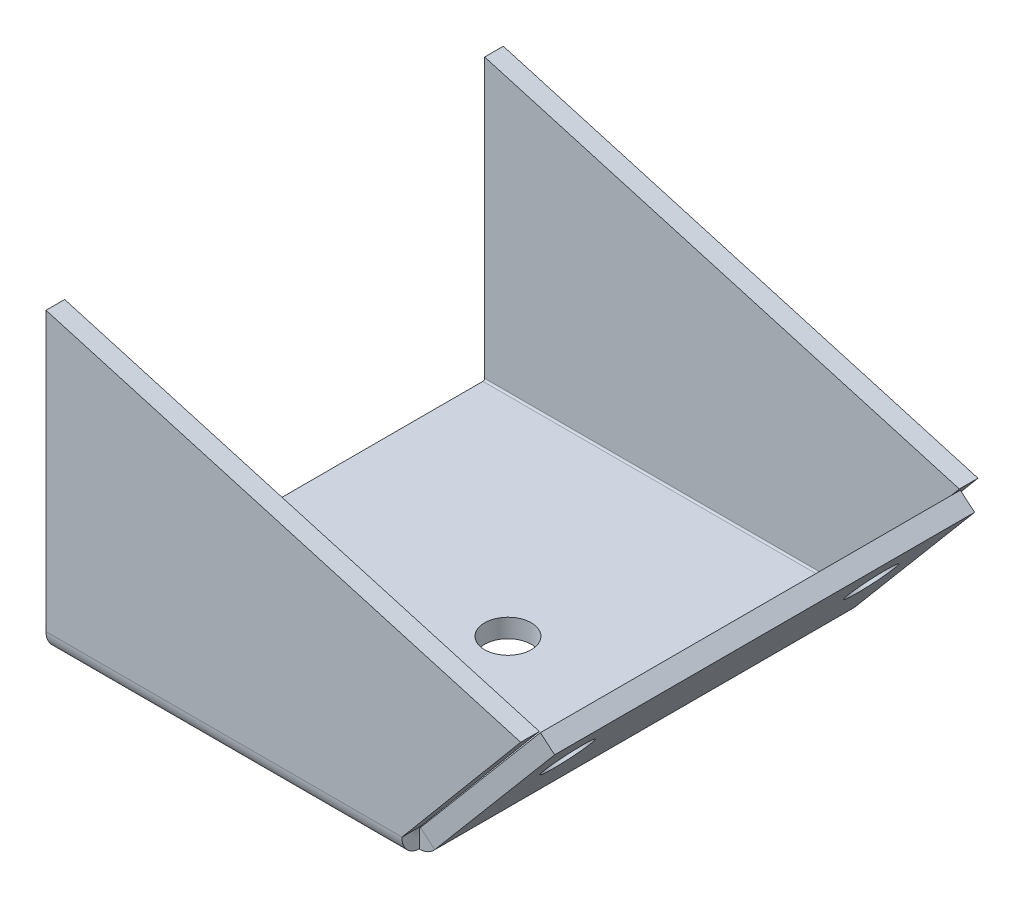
ISO-10303-21;
HEADER;
FILE_DESCRIPTION(('STEP AP214'),'2;1');
FILE_NAME('part.step','',(''),(''),'','','');
FILE_SCHEMA(('AUTOMOTIVE_DESIGN { 1 0 10303 214 1 1 1 1 }'));
ENDSEC;
DATA;
#1=APPLICATION_CONTEXT('core data for automotive mechanical design processes');
#2=APPLICATION_PROTOCOL_DEFINITION('international standard','automotive_design',2000,#1);
#3=PRODUCT_CONTEXT('',#1,'mechanical');
#4=PRODUCT('Part','Part','',(#3));
#5=PRODUCT_RELATED_PRODUCT_CATEGORY('part','',(#4));
#6=PRODUCT_DEFINITION_FORMATION('','',#4);
#7=PRODUCT_DEFINITION_CONTEXT('part definition',#1,'design');
#8=PRODUCT_DEFINITION('design','',#6,#7);
#9=PRODUCT_DEFINITION_SHAPE('','',#8);
#10=(LENGTH_UNIT() NAMED_UNIT(*) SI_UNIT(.MILLI.,.METRE.));
#11=(NAMED_UNIT(*) PLANE_ANGLE_UNIT() SI_UNIT($,.RADIAN.));
#12=(NAMED_UNIT(*) SI_UNIT($,.STERADIAN.) SOLID_ANGLE_UNIT());
#13=UNCERTAINTY_MEASURE_WITH_UNIT(LENGTH_MEASURE(1.E-05),#10,'distance_accuracy_value','');
#14=(GEOMETRIC_REPRESENTATION_CONTEXT(3) GLOBAL_UNCERTAINTY_ASSIGNED_CONTEXT((#13)) GLOBAL_UNIT_ASSIGNED_CONTEXT((#10,
#11,#12)) REPRESENTATION_CONTEXT('',''));
#15=CARTESIAN_POINT('',(0.,0.,0.));
#16=DIRECTION('',(0.,0.,1.));
#17=DIRECTION('',(1.,0.,0.));
#18=AXIS2_PLACEMENT_3D('',#15,#16,#17);
#19=CARTESIAN_POINT('',(-156.,8.,90.));
#20=DIRECTION('',(0.,1.,0.));
#21=DIRECTION('',(0.,0.,1.));
#22=AXIS2_PLACEMENT_3D('',#19,#20,#21);
#23=PLANE('',#22);
#24=CARTESIAN_POINT('',(-56.,8.,0.));
#25=DIRECTION('',(0.,1.,0.));
#26=DIRECTION('',(0.,0.,1.));
#27=AXIS2_PLACEMENT_3D('',#24,#25,#26);
#28=CIRCLE('',#27,10.);
#29=CARTESIAN_POINT('',(-56.,8.,10.));
#30=VERTEX_POINT('',#29);
#31=EDGE_CURVE('E536',#30,#30,#28,.T.);
#32=ORIENTED_EDGE('',*,*,#31,.F.);
#33=EDGE_LOOP('',(#32));
#34=FACE_BOUND('',#33,.T.);
#35=DIRECTION('',(0.,0.,-1.));
#36=VECTOR('',#35,1.);
#37=CARTESIAN_POINT('',(-4.05947288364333,8.,90.));
#38=LINE('',#37,#36);
#39=CARTESIAN_POINT('',(-4.05947288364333,8.,89.2634));
#40=VERTEX_POINT('',#39);
#41=CARTESIAN_POINT('',(-4.05947288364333,8.,-89.2633999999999));
#42=VERTEX_POINT('',#41);
#43=EDGE_CURVE('E397',#40,#42,#38,.T.);
#44=ORIENTED_EDGE('',*,*,#43,.T.);
#45=DIRECTION('',(-1.,0.,0.));
#46=VECTOR('',#45,1.);
#47=CARTESIAN_POINT('',(-156.,7.99999999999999,-89.2634));
#48=LINE('',#47,#46);
#49=CARTESIAN_POINT('',(-156.,8.,-89.2633999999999));
#50=VERTEX_POINT('',#49);
#51=EDGE_CURVE('E64',#50,#42,#48,.F.);
#52=ORIENTED_EDGE('',*,*,#51,.F.);
#53=DIRECTION('',(0.,0.,-1.));
#54=VECTOR('',#53,1.);
#55=CARTESIAN_POINT('',(-156.,8.,90.));
#56=LINE('',#55,#54);
#57=CARTESIAN_POINT('',(-156.,8.,89.2634));
#58=VERTEX_POINT('',#57);
#59=EDGE_CURVE('E395',#58,#50,#56,.T.);
#60=ORIENTED_EDGE('',*,*,#59,.F.);
#61=DIRECTION('',(1.,0.,0.));
#62=VECTOR('',#61,1.);
#63=CARTESIAN_POINT('',(-3.44139209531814,8.,89.2634));
#64=LINE('',#63,#62);
#65=EDGE_CURVE('E309',#40,#58,#64,.F.);
#66=ORIENTED_EDGE('',*,*,#65,.F.);
#67=EDGE_LOOP('',(#44,#52,#60,#66));
#68=FACE_BOUND('',#67,.T.);
#69=ADVANCED_FACE('F41',(#34,#68),#23,.T.);
#70=CARTESIAN_POINT('',(-156.,0.,90.));
#71=DIRECTION('',(0.,1.,0.));
#72=DIRECTION('',(0.,0.,1.));
#73=AXIS2_PLACEMENT_3D('',#70,#71,#72);
#74=PLANE('',#73);
#75=CARTESIAN_POINT('',(-56.,0.,0.));
#76=DIRECTION('',(0.,1.,0.));
#77=DIRECTION('',(0.,0.,1.));
#78=AXIS2_PLACEMENT_3D('',#75,#76,#77);
#79=CIRCLE('',#78,10.);
#80=CARTESIAN_POINT('',(-56.,0.,10.));
#81=VERTEX_POINT('',#80);
#82=EDGE_CURVE('E45',#81,#81,#79,.T.);
#83=ORIENTED_EDGE('',*,*,#82,.T.);
#84=EDGE_LOOP('',(#83));
#85=FACE_BOUND('',#84,.T.);
#86=DIRECTION('',(-1.,0.,0.));
#87=VECTOR('',#86,1.);
#88=CARTESIAN_POINT('',(-156.,0.,-89.2634));
#89=LINE('',#88,#87);
#90=CARTESIAN_POINT('',(-156.,0.,-89.2634));
#91=VERTEX_POINT('',#90);
#92=CARTESIAN_POINT('',(-4.05947288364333,0.,-89.2633999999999));
#93=VERTEX_POINT('',#92);
#94=EDGE_CURVE('E176',#91,#93,#89,.F.);
#95=ORIENTED_EDGE('',*,*,#94,.T.);
#96=DIRECTION('',(0.,0.,-1.));
#97=VECTOR('',#96,1.);
#98=CARTESIAN_POINT('',(-4.05947288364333,0.,90.));
#99=LINE('',#98,#97);
#100=CARTESIAN_POINT('',(-4.05947288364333,0.,89.2634));
#101=VERTEX_POINT('',#100);
#102=EDGE_CURVE('E390',#101,#93,#99,.T.);
#103=ORIENTED_EDGE('',*,*,#102,.F.);
#104=DIRECTION('',(1.,0.,0.));
#105=VECTOR('',#104,1.);
#106=CARTESIAN_POINT('',(-3.44139209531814,0.,89.2634));
#107=LINE('',#106,#105);
#108=CARTESIAN_POINT('',(-156.,0.,89.2634));
#109=VERTEX_POINT('',#108);
#110=EDGE_CURVE('E304',#101,#109,#107,.F.);
#111=ORIENTED_EDGE('',*,*,#110,.T.);
#112=DIRECTION('',(0.,0.,-1.));
#113=VECTOR('',#112,1.);
#114=CARTESIAN_POINT('',(-156.,0.,90.));
#115=LINE('',#114,#113);
#116=EDGE_CURVE('E393',#109,#91,#115,.T.);
#117=ORIENTED_EDGE('',*,*,#116,.T.);
#118=EDGE_LOOP('',(#95,#103,#111,#117));
#119=FACE_BOUND('',#118,.T.);
#120=ADVANCED_FACE('F481',(#85,#119),#74,.F.);
#121=CARTESIAN_POINT('',(-156.,0.,90.));
#122=DIRECTION('',(-1.,0.,0.));
#123=DIRECTION('',(0.,0.,1.));
#124=AXIS2_PLACEMENT_3D('',#121,#122,#123);
#125=PLANE('',#124);
#126=ORIENTED_EDGE('',*,*,#59,.T.);
#127=DIRECTION('',(0.,-1.,0.));
#128=VECTOR('',#127,1.);
#129=CARTESIAN_POINT('',(-156.,7.99999999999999,-89.2634));
#130=LINE('',#129,#128);
#131=EDGE_CURVE('E263',#50,#91,#130,.T.);
#132=ORIENTED_EDGE('',*,*,#131,.T.);
#133=ORIENTED_EDGE('',*,*,#116,.F.);
#134=DIRECTION('',(0.,-1.,0.));
#135=VECTOR('',#134,1.);
#136=CARTESIAN_POINT('',(-156.,8.,89.2634));
#137=LINE('',#136,#135);
#138=EDGE_CURVE('E377',#58,#109,#137,.T.);
#139=ORIENTED_EDGE('',*,*,#138,.F.);
#140=EDGE_LOOP('',(#126,#132,#133,#139));
#141=FACE_BOUND('',#140,.T.);
#142=ADVANCED_FACE('F488',(#141),#125,.T.);
#143=CARTESIAN_POINT('',(-4.05947288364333,0.,90.));
#144=DIRECTION('',(0.,0.,1.));
#145=DIRECTION('',(1.,0.,0.));
#146=AXIS2_PLACEMENT_3D('',#143,#144,#145);
#147=PLANE('',#146);
#148=DIRECTION('',(0.,1.,0.));
#149=VECTOR('',#148,1.);
#150=CARTESIAN_POINT('',(-4.05947288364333,0.,90.));
#151=LINE('',#150,#149);
#152=CARTESIAN_POINT('',(-4.05947288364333,0.,90.));
#153=VERTEX_POINT('',#152);
#154=CARTESIAN_POINT('',(-4.05947288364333,8.,90.));
#155=VERTEX_POINT('',#154);
#156=EDGE_CURVE('E11',#153,#155,#151,.T.);
#157=ORIENTED_EDGE('',*,*,#156,.F.);
#158=CARTESIAN_POINT('',(-4.05947288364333,8.7366,90.));
#159=DIRECTION('',(0.,0.,-1.));
#160=DIRECTION('',(-1.,0.,0.));
#161=AXIS2_PLACEMENT_3D('',#158,#159,#160);
#162=CIRCLE('',#161,8.7366);
#163=CARTESIAN_POINT('',(2.61783609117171,3.10262055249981,90.));
#164=VERTEX_POINT('',#163);
#165=EDGE_CURVE('E369',#153,#164,#162,.F.);
#166=ORIENTED_EDGE('',*,*,#165,.T.);
#167=DIRECTION('',(0.764291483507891,-0.644870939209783,0.));
#168=VECTOR('',#167,1.);
#169=CARTESIAN_POINT('',(-3.49649577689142,8.26158806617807,90.));
#170=LINE('',#169,#168);
#171=CARTESIAN_POINT('',(-3.49649577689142,8.26158806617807,90.));
#172=VERTEX_POINT('',#171);
#173=EDGE_CURVE('E50',#172,#164,#170,.T.);
#174=ORIENTED_EDGE('',*,*,#173,.F.);
#175=CARTESIAN_POINT('',(-4.05947288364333,8.7366,90.));
#176=DIRECTION('',(0.,0.,1.));
#177=DIRECTION('',(1.,0.,0.));
#178=AXIS2_PLACEMENT_3D('',#175,#176,#177);
#179=CIRCLE('',#178,0.7366);
#180=EDGE_CURVE('E366',#155,#172,#179,.T.);
#181=ORIENTED_EDGE('',*,*,#180,.F.);
#182=EDGE_LOOP('',(#157,#166,#174,#181));
#183=FACE_BOUND('',#182,.T.);
#184=ADVANCED_FACE('F43',(#183),#147,.T.);
#185=CARTESIAN_POINT('',(2.61783609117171,3.10262055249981,-90.));
#186=DIRECTION('',(0.,0.,-1.));
#187=DIRECTION('',(-1.,0.,0.));
#188=AXIS2_PLACEMENT_3D('',#185,#186,#187);
#189=PLANE('',#188);
#190=DIRECTION('',(-0.764291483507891,0.644870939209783,0.));
#191=VECTOR('',#190,1.);
#192=CARTESIAN_POINT('',(2.61783609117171,3.10262055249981,-90.));
#193=LINE('',#192,#191);
#194=CARTESIAN_POINT('',(2.61783609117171,3.10262055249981,-90.));
#195=VERTEX_POINT('',#194);
#196=CARTESIAN_POINT('',(-3.49649577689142,8.26158806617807,-90.));
#197=VERTEX_POINT('',#196);
#198=EDGE_CURVE('E410',#195,#197,#193,.T.);
#199=ORIENTED_EDGE('',*,*,#198,.F.);
#200=CARTESIAN_POINT('',(-4.05947288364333,8.7366,-90.));
#201=DIRECTION('',(0.,0.,-1.));
#202=DIRECTION('',(-1.,0.,0.));
#203=AXIS2_PLACEMENT_3D('',#200,#201,#202);
#204=CIRCLE('',#203,8.7366);
#205=CARTESIAN_POINT('',(-4.05947288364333,0.,-90.));
#206=VERTEX_POINT('',#205);
#207=EDGE_CURVE('E360',#206,#195,#204,.F.);
#208=ORIENTED_EDGE('',*,*,#207,.F.);
#209=DIRECTION('',(0.,-1.,0.));
#210=VECTOR('',#209,1.);
#211=CARTESIAN_POINT('',(-4.05947288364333,8.,-90.));
#212=LINE('',#211,#210);
#213=CARTESIAN_POINT('',(-4.05947288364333,8.,-90.));
#214=VERTEX_POINT('',#213);
#215=EDGE_CURVE('E407',#214,#206,#212,.T.);
#216=ORIENTED_EDGE('',*,*,#215,.F.);
#217=CARTESIAN_POINT('',(-4.05947288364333,8.7366,-90.));
#218=DIRECTION('',(0.,0.,1.));
#219=DIRECTION('',(1.,0.,0.));
#220=AXIS2_PLACEMENT_3D('',#217,#218,#219);
#221=CIRCLE('',#220,0.7366);
#222=EDGE_CURVE('E383',#214,#197,#221,.T.);
#223=ORIENTED_EDGE('',*,*,#222,.T.);
#224=EDGE_LOOP('',(#199,#208,#216,#223));
#225=FACE_BOUND('',#224,.T.);
#226=ADVANCED_FACE('F506',(#225),#189,.T.);
#227=CARTESIAN_POINT('',(-4.05947288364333,8.,-90.));
#228=DIRECTION('',(0.,0.,-1.));
#229=DIRECTION('',(-1.,0.,0.));
#230=AXIS2_PLACEMENT_3D('',#227,#228,#229);
#231=PLANE('',#230);
#232=DIRECTION('',(0.644870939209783,0.764291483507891,0.));
#233=VECTOR('',#232,1.);
#234=CARTESIAN_POINT('',(0.,0.,-90.));
#235=LINE('',#234,#233);
#236=CARTESIAN_POINT('',(54.,64.,-90.));
#237=VERTEX_POINT('',#236);
#238=EDGE_CURVE('E373',#195,#237,#235,.T.);
#239=ORIENTED_EDGE('',*,*,#238,.F.);
#240=ORIENTED_EDGE('',*,*,#198,.T.);
#241=DIRECTION('',(0.644870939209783,0.764291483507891,0.));
#242=VECTOR('',#241,1.);
#243=CARTESIAN_POINT('',(-6.11433186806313,5.15896751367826,-90.));
#244=LINE('',#243,#242);
#245=CARTESIAN_POINT('',(47.8856681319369,69.1589675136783,-90.));
#246=VERTEX_POINT('',#245);
#247=EDGE_CURVE('E380',#197,#246,#244,.T.);
#248=ORIENTED_EDGE('',*,*,#247,.T.);
#249=DIRECTION('',(0.764291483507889,-0.644870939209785,0.));
#250=VECTOR('',#249,1.);
#251=CARTESIAN_POINT('',(47.8856681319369,69.1589675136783,-90.));
#252=LINE('',#251,#250);
#253=EDGE_CURVE('E376',#246,#237,#252,.T.);
#254=ORIENTED_EDGE('',*,*,#253,.T.);
#255=EDGE_LOOP('',(#239,#240,#248,#254));
#256=FACE_BOUND('',#255,.T.);
#257=ADVANCED_FACE('F503',(#256),#231,.T.);
#258=CARTESIAN_POINT('',(0.,0.,90.));
#259=DIRECTION('',(-0.764291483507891,0.644870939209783,0.));
#260=DIRECTION('',(-0.644870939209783,-0.764291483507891,0.));
#261=AXIS2_PLACEMENT_3D('',#258,#259,#260);
#262=PLANE('',#261);
#263=CARTESIAN_POINT('',(34.6538718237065,41.0712554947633,-65.));
#264=DIRECTION('',(-0.764291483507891,0.644870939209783,0.));
#265=DIRECTION('',(-0.644870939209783,-0.764291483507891,0.));
#266=AXIS2_PLACEMENT_3D('',#263,#264,#265);
#267=CIRCLE('',#266,10.);
#268=CARTESIAN_POINT('',(28.2051624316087,33.4283406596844,-65.));
#269=VERTEX_POINT('',#268);
#270=EDGE_CURVE('E530',#269,#269,#267,.T.);
#271=ORIENTED_EDGE('',*,*,#270,.T.);
#272=EDGE_LOOP('',(#271));
#273=FACE_BOUND('',#272,.T.);
#274=CARTESIAN_POINT('',(34.6538718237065,41.0712554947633,65.));
#275=DIRECTION('',(-0.764291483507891,0.644870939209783,0.));
#276=DIRECTION('',(-0.644870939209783,-0.764291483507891,0.));
#277=AXIS2_PLACEMENT_3D('',#274,#275,#276);
#278=CIRCLE('',#277,9.99999999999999);
#279=CARTESIAN_POINT('',(28.2051624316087,33.4283406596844,65.));
#280=VERTEX_POINT('',#279);
#281=EDGE_CURVE('E522',#280,#280,#278,.T.);
#282=ORIENTED_EDGE('',*,*,#281,.T.);
#283=EDGE_LOOP('',(#282));
#284=FACE_BOUND('',#283,.T.);
#285=ORIENTED_EDGE('',*,*,#238,.T.);
#286=DIRECTION('',(0.,0.,-1.));
#287=VECTOR('',#286,1.);
#288=CARTESIAN_POINT('',(54.,64.,90.));
#289=LINE('',#288,#287);
#290=CARTESIAN_POINT('',(54.,64.,90.));
#291=VERTEX_POINT('',#290);
#292=EDGE_CURVE('E405',#291,#237,#289,.T.);
#293=ORIENTED_EDGE('',*,*,#292,.F.);
#294=DIRECTION('',(0.644870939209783,0.764291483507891,0.));
#295=VECTOR('',#294,1.);
#296=CARTESIAN_POINT('',(0.,0.,90.));
#297=LINE('',#296,#295);
#298=EDGE_CURVE('E357',#164,#291,#297,.T.);
#299=ORIENTED_EDGE('',*,*,#298,.F.);
#300=DIRECTION('',(0.,0.,-1.));
#301=VECTOR('',#300,1.);
#302=CARTESIAN_POINT('',(2.61783609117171,3.10262055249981,90.));
#303=LINE('',#302,#301);
#304=EDGE_CURVE('E372',#164,#195,#303,.T.);
#305=ORIENTED_EDGE('',*,*,#304,.T.);
#306=EDGE_LOOP('',(#285,#293,#299,#305));
#307=FACE_BOUND('',#306,.T.);
#308=ADVANCED_FACE('F429',(#273,#284,#307),#262,.F.);
#309=CARTESIAN_POINT('',(47.8856681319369,69.1589675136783,90.));
#310=DIRECTION('',(0.644870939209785,0.764291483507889,0.));
#311=DIRECTION('',(-0.764291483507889,0.644870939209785,0.));
#312=AXIS2_PLACEMENT_3D('',#309,#310,#311);
#313=PLANE('',#312);
#314=ORIENTED_EDGE('',*,*,#253,.F.);
#315=DIRECTION('',(0.,0.,-1.));
#316=VECTOR('',#315,1.);
#317=CARTESIAN_POINT('',(47.8856681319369,69.1589675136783,90.));
#318=LINE('',#317,#316);
#319=CARTESIAN_POINT('',(47.8856681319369,69.1589675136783,90.));
#320=VERTEX_POINT('',#319);
#321=EDGE_CURVE('E403',#320,#246,#318,.T.);
#322=ORIENTED_EDGE('',*,*,#321,.F.);
#323=DIRECTION('',(0.764291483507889,-0.644870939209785,0.));
#324=VECTOR('',#323,1.);
#325=CARTESIAN_POINT('',(47.8856681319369,69.1589675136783,90.));
#326=LINE('',#325,#324);
#327=EDGE_CURVE('E359',#320,#291,#326,.T.);
#328=ORIENTED_EDGE('',*,*,#327,.T.);
#329=ORIENTED_EDGE('',*,*,#292,.T.);
#330=EDGE_LOOP('',(#314,#322,#328,#329));
#331=FACE_BOUND('',#330,.T.);
#332=ADVANCED_FACE('F432',(#331),#313,.T.);
#333=CARTESIAN_POINT('',(-6.11433186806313,5.15896751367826,90.));
#334=DIRECTION('',(-0.764291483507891,0.644870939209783,0.));
#335=DIRECTION('',(-0.644870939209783,-0.764291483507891,0.));
#336=AXIS2_PLACEMENT_3D('',#333,#334,#335);
#337=PLANE('',#336);
#338=CARTESIAN_POINT('',(28.5395399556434,46.2302230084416,-65.));
#339=DIRECTION('',(-0.764291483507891,0.644870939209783,0.));
#340=DIRECTION('',(-0.644870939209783,-0.764291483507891,0.));
#341=AXIS2_PLACEMENT_3D('',#338,#339,#340);
#342=CIRCLE('',#341,10.);
#343=CARTESIAN_POINT('',(22.0908305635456,38.5873081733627,-65.));
#344=VERTEX_POINT('',#343);
#345=EDGE_CURVE('E533',#344,#344,#342,.T.);
#346=ORIENTED_EDGE('',*,*,#345,.F.);
#347=EDGE_LOOP('',(#346));
#348=FACE_BOUND('',#347,.T.);
#349=CARTESIAN_POINT('',(28.5395399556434,46.2302230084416,65.));
#350=DIRECTION('',(-0.764291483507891,0.644870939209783,0.));
#351=DIRECTION('',(-0.644870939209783,-0.764291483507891,0.));
#352=AXIS2_PLACEMENT_3D('',#349,#350,#351);
#353=CIRCLE('',#352,9.99999999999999);
#354=CARTESIAN_POINT('',(22.0908305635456,38.5873081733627,65.));
#355=VERTEX_POINT('',#354);
#356=EDGE_CURVE('E525',#355,#355,#353,.T.);
#357=ORIENTED_EDGE('',*,*,#356,.F.);
#358=EDGE_LOOP('',(#357));
#359=FACE_BOUND('',#358,.T.);
#360=ORIENTED_EDGE('',*,*,#247,.F.);
#361=DIRECTION('',(0.,0.,-1.));
#362=VECTOR('',#361,1.);
#363=CARTESIAN_POINT('',(-3.49649577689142,8.26158806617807,90.));
#364=LINE('',#363,#362);
#365=EDGE_CURVE('E400',#172,#197,#364,.T.);
#366=ORIENTED_EDGE('',*,*,#365,.F.);
#367=DIRECTION('',(0.644870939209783,0.764291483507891,0.));
#368=VECTOR('',#367,1.);
#369=CARTESIAN_POINT('',(-6.11433186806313,5.15896751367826,90.));
#370=LINE('',#369,#368);
#371=EDGE_CURVE('E363',#172,#320,#370,.T.);
#372=ORIENTED_EDGE('',*,*,#371,.T.);
#373=ORIENTED_EDGE('',*,*,#321,.T.);
#374=EDGE_LOOP('',(#360,#366,#372,#373));
#375=FACE_BOUND('',#374,.T.);
#376=ADVANCED_FACE('F435',(#348,#359,#375),#337,.T.);
#377=CARTESIAN_POINT('',(-4.05947288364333,8.7366,90.));
#378=DIRECTION('',(0.,0.,-1.));
#379=DIRECTION('',(-1.,0.,0.));
#380=AXIS2_PLACEMENT_3D('',#377,#378,#379);
#381=CYLINDRICAL_SURFACE('',#380,0.7366);
#382=ORIENTED_EDGE('',*,*,#222,.F.);
#383=DIRECTION('',(0.,0.,-1.));
#384=VECTOR('',#383,1.);
#385=CARTESIAN_POINT('',(-4.05947288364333,7.99999999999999,-89.2634));
#386=LINE('',#385,#384);
#387=EDGE_CURVE('E57',#42,#214,#386,.T.);
#388=ORIENTED_EDGE('',*,*,#387,.F.);
#389=ORIENTED_EDGE('',*,*,#43,.F.);
#390=EDGE_CURVE('E398',#155,#40,#38,.T.);
#391=ORIENTED_EDGE('',*,*,#390,.F.);
#392=ORIENTED_EDGE('',*,*,#180,.T.);
#393=ORIENTED_EDGE('',*,*,#365,.T.);
#394=EDGE_LOOP('',(#382,#388,#389,#391,#392,#393));
#395=FACE_BOUND('',#394,.T.);
#396=ADVANCED_FACE('F436',(#395),#381,.F.);
#397=CARTESIAN_POINT('',(-4.05947288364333,8.7366,90.));
#398=DIRECTION('',(0.,0.,-1.));
#399=DIRECTION('',(-1.,0.,0.));
#400=AXIS2_PLACEMENT_3D('',#397,#398,#399);
#401=CYLINDRICAL_SURFACE('',#400,8.7366);
#402=ORIENTED_EDGE('',*,*,#207,.T.);
#403=ORIENTED_EDGE('',*,*,#304,.F.);
#404=ORIENTED_EDGE('',*,*,#165,.F.);
#405=EDGE_CURVE('E391',#153,#101,#99,.T.);
#406=ORIENTED_EDGE('',*,*,#405,.T.);
#407=ORIENTED_EDGE('',*,*,#102,.T.);
#408=DIRECTION('',(0.,0.,-1.));
#409=VECTOR('',#408,1.);
#410=CARTESIAN_POINT('',(-4.05947288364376,0.,90.));
#411=LINE('',#410,#409);
#412=EDGE_CURVE('E266',#206,#93,#411,.F.);
#413=ORIENTED_EDGE('',*,*,#412,.F.);
#414=EDGE_LOOP('',(#402,#403,#404,#406,#407,#413));
#415=FACE_BOUND('',#414,.T.);
#416=ADVANCED_FACE('F425',(#415),#401,.T.);
#417=CARTESIAN_POINT('',(-4.05947288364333,8.7366,90.));
#418=DIRECTION('',(0.,0.,1.));
#419=DIRECTION('',(1.,0.,0.));
#420=AXIS2_PLACEMENT_3D('',#417,#418,#419);
#421=PLANE('',#420);
#422=ORIENTED_EDGE('',*,*,#298,.T.);
#423=ORIENTED_EDGE('',*,*,#327,.F.);
#424=ORIENTED_EDGE('',*,*,#371,.F.);
#425=ORIENTED_EDGE('',*,*,#173,.T.);
#426=EDGE_LOOP('',(#422,#423,#424,#425));
#427=FACE_BOUND('',#426,.T.);
#428=ADVANCED_FACE('F414',(#427),#421,.T.);
#429=CARTESIAN_POINT('',(-4.05947288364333,8.,90.));
#430=DIRECTION('',(-1.,0.,0.));
#431=DIRECTION('',(0.,0.,1.));
#432=AXIS2_PLACEMENT_3D('',#429,#430,#431);
#433=PLANE('',#432);
#434=DIRECTION('',(0.,-1.,0.));
#435=VECTOR('',#434,1.);
#436=CARTESIAN_POINT('',(-4.05947288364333,8.,89.2634));
#437=LINE('',#436,#435);
#438=EDGE_CURVE('E303',#40,#101,#437,.T.);
#439=ORIENTED_EDGE('',*,*,#438,.T.);
#440=ORIENTED_EDGE('',*,*,#405,.F.);
#441=ORIENTED_EDGE('',*,*,#156,.T.);
#442=ORIENTED_EDGE('',*,*,#390,.T.);
#443=EDGE_LOOP('',(#439,#440,#441,#442));
#444=FACE_BOUND('',#443,.T.);
#445=ADVANCED_FACE('F334',(#444),#433,.T.);
#446=CARTESIAN_POINT('',(-156.,8.73660000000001,89.2634));
#447=DIRECTION('',(-1.,0.,0.));
#448=DIRECTION('',(0.,0.,1.));
#449=AXIS2_PLACEMENT_3D('',#446,#447,#448);
#450=PLANE('',#449);
#451=DIRECTION('',(0.,0.,1.));
#452=VECTOR('',#451,1.);
#453=CARTESIAN_POINT('',(-156.,8.73660000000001,90.));
#454=LINE('',#453,#452);
#455=CARTESIAN_POINT('',(-156.,8.73660000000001,90.));
#456=VERTEX_POINT('',#455);
#457=CARTESIAN_POINT('',(-156.,8.73660000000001,98.));
#458=VERTEX_POINT('',#457);
#459=EDGE_CURVE('E269',#456,#458,#454,.T.);
#460=ORIENTED_EDGE('',*,*,#459,.F.);
#461=CARTESIAN_POINT('',(-156.,8.73660000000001,89.2634));
#462=DIRECTION('',(1.,0.,0.));
#463=DIRECTION('',(0.,0.,-1.));
#464=AXIS2_PLACEMENT_3D('',#461,#462,#463);
#465=CIRCLE('',#464,0.736600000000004);
#466=EDGE_CURVE('E305',#58,#456,#465,.F.);
#467=ORIENTED_EDGE('',*,*,#466,.F.);
#468=ORIENTED_EDGE('',*,*,#138,.T.);
#469=CARTESIAN_POINT('',(-156.,8.73660000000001,89.2634));
#470=DIRECTION('',(1.,0.,0.));
#471=DIRECTION('',(0.,0.,-1.));
#472=AXIS2_PLACEMENT_3D('',#469,#470,#471);
#473=CIRCLE('',#472,8.7366);
#474=EDGE_CURVE('E300',#109,#458,#473,.F.);
#475=ORIENTED_EDGE('',*,*,#474,.T.);
#476=EDGE_LOOP('',(#460,#467,#468,#475));
#477=FACE_BOUND('',#476,.T.);
#478=ADVANCED_FACE('F331',(#477),#450,.T.);
#479=CARTESIAN_POINT('',(-3.44139209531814,8.73659999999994,98.08));
#480=CARTESIAN_POINT('',(-3.49290811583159,7.58230206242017,98.08));
#481=CARTESIAN_POINT('',(-3.544405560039,6.42887360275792,97.8505275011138));
#482=CARTESIAN_POINT('',(-3.64741902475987,4.29639289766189,96.9672250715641));
#483=CARTESIAN_POINT('',(-3.6989257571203,3.31838738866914,96.3137426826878));
#484=CARTESIAN_POINT('',(-3.80193922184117,1.68625731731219,94.6816126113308));
#485=CARTESIAN_POINT('',(-3.8534459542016,1.03277492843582,93.703607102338));
#486=CARTESIAN_POINT('',(-3.95645941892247,0.149472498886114,91.571126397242));
#487=CARTESIAN_POINT('',(-4.00795686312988,-0.0799999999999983,90.4176979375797));
#488=CARTESIAN_POINT('',(-4.05947288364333,-0.0799999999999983,89.2634));
#489=CARTESIAN_POINT('',(-3.44139209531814,8.73659999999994,98.));
#490=CARTESIAN_POINT('',(-3.49290809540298,7.59277596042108,98.));
#491=CARTESIAN_POINT('',(-3.544405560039,6.44981343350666,97.7726096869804));
#492=CARTESIAN_POINT('',(-3.64741902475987,4.33668241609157,96.8973221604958));
#493=CARTESIAN_POINT('',(-3.6989257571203,3.36755112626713,96.2497693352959));
#494=CARTESIAN_POINT('',(-3.80193922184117,1.75023066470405,94.6324488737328));
#495=CARTESIAN_POINT('',(-3.8534459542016,1.10267783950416,93.6633175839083));
#496=CARTESIAN_POINT('',(-3.95645941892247,0.227390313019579,91.5501865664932));
#497=CARTESIAN_POINT('',(-4.00795688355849,0.,90.4072240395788));
#498=CARTESIAN_POINT('',(-4.05947288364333,0.,89.2634));
#499=CARTESIAN_POINT('',(-3.44139209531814,8.7366,90.));
#500=CARTESIAN_POINT('',(-3.49290605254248,8.64016576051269,90.));
#501=CARTESIAN_POINT('',(-3.544405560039,8.54379650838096,89.9808282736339));
#502=CARTESIAN_POINT('',(-3.64741902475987,8.3656342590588,89.9070310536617));
#503=CARTESIAN_POINT('',(-3.6989257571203,8.28392488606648,89.8524345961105));
#504=CARTESIAN_POINT('',(-3.80193922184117,8.1475654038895,89.7160751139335));
#505=CARTESIAN_POINT('',(-3.8534459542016,8.09296894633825,89.6343657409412));
#506=CARTESIAN_POINT('',(-3.95645941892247,8.01917172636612,89.456203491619));
#507=CARTESIAN_POINT('',(-4.00795892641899,8.,89.3598342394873));
#508=CARTESIAN_POINT('',(-4.05947288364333,8.,89.2634));
#509=CARTESIAN_POINT('',(-3.44139209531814,8.7366,89.9192));
#510=CARTESIAN_POINT('',(-3.49290603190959,8.65074439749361,89.9192));
#511=CARTESIAN_POINT('',(-3.544405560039,8.56494573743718,89.9021312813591));
#512=CARTESIAN_POINT('',(-3.64741902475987,8.40632667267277,89.8364291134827));
#513=CARTESIAN_POINT('',(-3.6989257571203,8.33358026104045,89.7878215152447));
#514=CARTESIAN_POINT('',(-3.80193922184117,8.21217848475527,89.6664197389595));
#515=CARTESIAN_POINT('',(-3.8534459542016,8.16357088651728,89.5936733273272));
#516=CARTESIAN_POINT('',(-3.95645941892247,8.09786871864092,89.4350542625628));
#517=CARTESIAN_POINT('',(-4.00795894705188,8.0808,89.3492556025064));
#518=CARTESIAN_POINT('',(-4.05947288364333,8.0808,89.2634));
#519=B_SPLINE_SURFACE_WITH_KNOTS('',1,3,((#479,#480,#481,#482,#483,#484,#485,#486,#487,#488),
(#489,#490,#491,#492,#493,#494,#495,#496,#497,#498),(#499,#500,#501,#502,#503,#504,#505,#506,
#507,#508),(#509,#510,#511,#512,#513,#514,#515,#516,#517,#518)),.UNSPECIFIED.,.F.,.F.,.F.,(2,1,
1,2),(4,2,2,2,4),(-0.01,0.,1.,1.0101),(0.,0.25,0.5,0.75,1.),.UNSPECIFIED.);
#520=CARTESIAN_POINT('',(-3.44139209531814,8.7366,90.));
#521=CARTESIAN_POINT('',(-3.44783043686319,8.72454739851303,90.0000002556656));
#522=CARTESIAN_POINT('',(-3.45426877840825,8.71249481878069,89.9997041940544));
#523=CARTESIAN_POINT('',(-3.46714546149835,8.68841868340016,89.9985212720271));
#524=CARTESIAN_POINT('',(-3.47358380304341,8.67639512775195,89.997634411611));
#525=CARTESIAN_POINT('',(-3.48646048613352,8.65240602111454,89.9952717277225));
#526=CARTESIAN_POINT('',(-3.49289882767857,8.64044047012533,89.9937959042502));
#527=CARTESIAN_POINT('',(-3.50577551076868,8.61659619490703,89.9902589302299));
#528=CARTESIAN_POINT('',(-3.51221385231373,8.60471747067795,89.988197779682));
#529=CARTESIAN_POINT('',(-3.52509053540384,8.5810754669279,89.983495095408));
#530=CARTESIAN_POINT('',(-3.5315288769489,8.56931218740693,89.980853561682));
#531=CARTESIAN_POINT('',(-3.544405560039,8.54592941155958,89.9749964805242));
#532=CARTESIAN_POINT('',(-3.55084390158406,8.53430991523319,89.9717809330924));
#533=CARTESIAN_POINT('',(-3.56372058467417,8.51124269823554,89.9647835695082));
#534=CARTESIAN_POINT('',(-3.57015892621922,8.49979497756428,89.9610017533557));
#535=CARTESIAN_POINT('',(-3.58303560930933,8.4770988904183,89.9528809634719));
#536=CARTESIAN_POINT('',(-3.58947395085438,8.46585052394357,89.9485419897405));
#537=CARTESIAN_POINT('',(-3.60235063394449,8.44358024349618,89.9393173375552));
#538=CARTESIAN_POINT('',(-3.60878897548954,8.43255832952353,89.9344316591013));
#539=CARTESIAN_POINT('',(-3.62166565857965,8.41076750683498,89.9241253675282));
#540=CARTESIAN_POINT('',(-3.62810400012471,8.3999985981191,89.918704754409));
#541=CARTESIAN_POINT('',(-3.64098068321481,8.37873972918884,89.907341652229));
#542=CARTESIAN_POINT('',(-3.64741902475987,8.36824976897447,89.9013991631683));
#543=CARTESIAN_POINT('',(-3.66029570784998,8.34757406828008,89.8890066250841));
#544=CARTESIAN_POINT('',(-3.66673404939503,8.33738832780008,89.8825565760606));
#545=CARTESIAN_POINT('',(-3.67961073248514,8.31734560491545,89.8691644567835));
#546=CARTESIAN_POINT('',(-3.68604907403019,8.30748862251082,89.8622223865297));
#547=CARTESIAN_POINT('',(-3.6989257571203,8.28812716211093,89.8478629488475));
#548=CARTESIAN_POINT('',(-3.70536409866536,8.27862268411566,89.840445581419));
#549=CARTESIAN_POINT('',(-3.71824078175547,8.25998912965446,89.825153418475));
#550=CARTESIAN_POINT('',(-3.72467912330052,8.25086005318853,89.8172786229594));
#551=CARTESIAN_POINT('',(-3.73755580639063,8.23299929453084,89.8010905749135));
#552=CARTESIAN_POINT('',(-3.74399414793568,8.22426761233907,89.7927773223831));
#553=CARTESIAN_POINT('',(-3.75687083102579,8.2072226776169,89.7757323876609));
#554=CARTESIAN_POINT('',(-3.76330917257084,8.19890942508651,89.7670007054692));
#555=CARTESIAN_POINT('',(-3.77618585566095,8.18272137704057,89.7491399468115));
#556=CARTESIAN_POINT('',(-3.78262419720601,8.17484658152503,89.7400108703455));
#557=CARTESIAN_POINT('',(-3.79550088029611,8.15955441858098,89.7213773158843));
#558=CARTESIAN_POINT('',(-3.80193922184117,8.15213705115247,89.7118728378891));
#559=CARTESIAN_POINT('',(-3.81481590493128,8.13777761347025,89.6925113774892));
#560=CARTESIAN_POINT('',(-3.82125424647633,8.13083554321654,89.6826543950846));
#561=CARTESIAN_POINT('',(-3.83413092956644,8.11744342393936,89.6626116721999));
#562=CARTESIAN_POINT('',(-3.84056927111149,8.1109933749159,89.6524259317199));
#563=CARTESIAN_POINT('',(-3.8534459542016,8.0986008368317,89.6317502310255));
#564=CARTESIAN_POINT('',(-3.85988429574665,8.09265834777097,89.6212602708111));
#565=CARTESIAN_POINT('',(-3.87276097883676,8.08129524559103,89.6000014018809));
#566=CARTESIAN_POINT('',(-3.87919932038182,8.07587463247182,89.589232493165));
#567=CARTESIAN_POINT('',(-3.89207600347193,8.06556834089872,89.5674416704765));
#568=CARTESIAN_POINT('',(-3.89851434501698,8.06068266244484,89.5564197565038));
#569=CARTESIAN_POINT('',(-3.91139102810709,8.05145801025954,89.5341494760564));
#570=CARTESIAN_POINT('',(-3.91782936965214,8.04711903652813,89.5229011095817));
#571=CARTESIAN_POINT('',(-3.93070605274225,8.03899824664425,89.5002050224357));
#572=CARTESIAN_POINT('',(-3.93714439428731,8.03521643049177,89.4887573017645));
#573=CARTESIAN_POINT('',(-3.95002107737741,8.02821906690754,89.4656900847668));
#574=CARTESIAN_POINT('',(-3.95645941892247,8.0250035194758,89.4540705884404));
#575=CARTESIAN_POINT('',(-3.96933610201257,8.01914643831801,89.4306878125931));
#576=CARTESIAN_POINT('',(-3.97577444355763,8.01650490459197,89.4189245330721));
#577=CARTESIAN_POINT('',(-3.98865112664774,8.011802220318,89.395282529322));
#578=CARTESIAN_POINT('',(-3.99508946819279,8.00974106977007,89.383403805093));
#579=CARTESIAN_POINT('',(-4.0079661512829,8.00620409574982,89.3595595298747));
#580=CARTESIAN_POINT('',(-4.01440449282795,8.00472827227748,89.3475939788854));
#581=CARTESIAN_POINT('',(-4.02728117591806,8.00236558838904,89.323604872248));
#582=CARTESIAN_POINT('',(-4.03371951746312,8.00147872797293,89.3115813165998));
#583=CARTESIAN_POINT('',(-4.04659620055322,8.00029580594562,89.2875051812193));
#584=CARTESIAN_POINT('',(-4.05303454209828,7.99999974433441,89.275452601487));
#585=CARTESIAN_POINT('',(-4.05947288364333,8.,89.2634));
#586=B_SPLINE_CURVE_WITH_KNOTS('',3,(#520,#521,#522,#523,#524,#525,#526,#527,#528,#529,#530,
#531,#532,#533,#534,#535,#536,#537,#538,#539,#540,#541,#542,#543,#544,#545,#546,#547,#548,#549,
#550,#551,#552,#553,#554,#555,#556,#557,#558,#559,#560,#561,#562,#563,#564,#565,#566,#567,#568,
#569,#570,#571,#572,#573,#574,#575,#576,#577,#578,#579,#580,#581,#582,#583,#584,#585),
.UNSPECIFIED.,.F.,.F.,(4,2,2,2,2,2,2,2,2,2,2,2,2,2,2,2,2,2,2,2,2,2,2,2,2,2,2,2,2,2,2,2,4),(0.,
0.0409901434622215,0.0819802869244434,0.122970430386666,0.163960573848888,0.20495071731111,
0.245940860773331,0.286931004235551,0.327921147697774,0.368911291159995,0.409901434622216,
0.450891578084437,0.491881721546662,0.532871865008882,0.573862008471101,0.614852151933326,
0.655842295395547,0.696832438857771,0.737822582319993,0.778812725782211,0.819802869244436,
0.860793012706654,0.901783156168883,0.9427732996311,0.983763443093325,1.02475358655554,
1.06574373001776,1.10673387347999,1.14772401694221,1.18871416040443,1.22970430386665,
1.27069444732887,1.3116845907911),.UNSPECIFIED.);
#587=CARTESIAN_POINT('',(-3.44139209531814,8.73660000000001,90.));
#588=VERTEX_POINT('',#587);
#589=EDGE_CURVE('E299',#588,#40,#586,.T.);
#590=DIRECTION('',(0.,0.,1.));
#591=VECTOR('',#590,1.);
#592=CARTESIAN_POINT('',(-3.44139209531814,8.7366,90.));
#593=LINE('',#592,#591);
#594=CARTESIAN_POINT('',(-3.44139209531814,8.7366,98.));
#595=VERTEX_POINT('',#594);
#596=EDGE_CURVE('E272',#588,#595,#593,.T.);
#597=CARTESIAN_POINT('',(-3.44139209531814,8.73659999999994,98.));
#598=CARTESIAN_POINT('',(-3.45247100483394,8.49062140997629,98.000026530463));
#599=CARTESIAN_POINT('',(-3.46354975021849,8.24464662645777,97.9896128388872));
#600=CARTESIAN_POINT('',(-3.48570622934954,7.75446054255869,97.9480966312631));
#601=CARTESIAN_POINT('',(-3.49678396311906,7.51024915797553,97.9169951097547));
#602=CARTESIAN_POINT('',(-3.51893042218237,7.02550515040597,97.834326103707));
#603=CARTESIAN_POINT('',(-3.52999914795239,6.78496988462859,97.7827741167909));
#604=CARTESIAN_POINT('',(-3.55213745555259,6.309103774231,97.6595799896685));
#605=CARTESIAN_POINT('',(-3.56320703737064,6.07377286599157,97.5879380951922));
#606=CARTESIAN_POINT('',(-3.58535149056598,5.60987681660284,97.4250326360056));
#607=CARTESIAN_POINT('',(-3.59642636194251,5.38131496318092,97.3337597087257));
#608=CARTESIAN_POINT('',(-3.61857659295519,4.93269830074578,97.1322612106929));
#609=CARTESIAN_POINT('',(-3.6296519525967,4.71264367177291,97.022035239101));
#610=CARTESIAN_POINT('',(-3.65179956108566,4.28265442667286,96.783439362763));
#611=CARTESIAN_POINT('',(-3.66287181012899,4.0727179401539,96.6550728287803));
#612=CARTESIAN_POINT('',(-3.68501629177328,3.66441777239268,96.3810955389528));
#613=CARTESIAN_POINT('',(-3.69608852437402,3.46605402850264,96.2354848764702));
#614=CARTESIAN_POINT('',(-3.71823384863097,3.08231390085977,95.9280582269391));
#615=CARTESIAN_POINT('',(-3.72930694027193,2.89693732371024,95.7662424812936));
#616=CARTESIAN_POINT('',(-3.75145287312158,2.54048858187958,95.4275563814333));
#617=CARTESIAN_POINT('',(-3.76252571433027,2.36941641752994,95.2506860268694));
#618=CARTESIAN_POINT('',(-3.78467365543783,2.04276111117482,94.8831123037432));
#619=CARTESIAN_POINT('',(-3.79574875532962,1.88718118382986,94.6924060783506));
#620=CARTESIAN_POINT('',(-3.81789778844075,1.59266152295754,94.2985551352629));
#621=CARTESIAN_POINT('',(-3.82897172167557,1.45372153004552,94.0954106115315));
#622=CARTESIAN_POINT('',(-3.85112268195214,1.19344070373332,93.6780818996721));
#623=CARTESIAN_POINT('',(-3.86219970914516,1.07210368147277,93.4638953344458));
#624=CARTESIAN_POINT('',(-3.8843539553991,0.847931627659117,93.0260564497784));
#625=CARTESIAN_POINT('',(-3.89543117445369,0.745096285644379,92.8024042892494));
#626=CARTESIAN_POINT('',(-3.91758087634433,0.558700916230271,92.3473203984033));
#627=CARTESIAN_POINT('',(-3.92865335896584,0.47513187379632,92.115892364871));
#628=CARTESIAN_POINT('',(-3.95079340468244,0.327823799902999,91.6469053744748));
#629=CARTESIAN_POINT('',(-3.96186096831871,0.264079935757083,91.4093479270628));
#630=CARTESIAN_POINT('',(-3.98736379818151,0.140548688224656,90.8567179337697));
#631=CARTESIAN_POINT('',(-4.00180091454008,0.0878437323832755,90.5400172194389));
#632=CARTESIAN_POINT('',(-4.0234399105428,0.035143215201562,90.0624600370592));
#633=CARTESIAN_POINT('',(-4.03064641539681,0.0219692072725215,89.9029395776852));
#634=CARTESIAN_POINT('',(-4.04505904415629,0.00439861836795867,89.5834255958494));
#635=CARTESIAN_POINT('',(-4.05226516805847,1.50711594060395E-06,89.423432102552));
#636=CARTESIAN_POINT('',(-4.05947288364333,0.,89.2634));
#637=B_SPLINE_CURVE_WITH_KNOTS('',3,(#597,#598,#599,#600,#601,#602,#603,#604,#605,#606,#607,
#608,#609,#610,#611,#612,#613,#614,#615,#616,#617,#618,#619,#620,#621,#622,#623,#624,#625,#626,
#627,#628,#629,#630,#631,#632,#633,#634,#635,#636),.UNSPECIFIED.,.F.,.F.,(4,2,2,2,2,2,2,2,2,2,2,
2,2,2,2,2,2,2,2,4),(0.,0.738458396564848,1.47688129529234,2.21474567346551,2.95260102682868,
3.6908090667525,4.42903272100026,5.16711938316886,5.90520204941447,6.64327372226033,
7.38134541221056,8.11956993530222,8.8577829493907,9.59615555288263,10.3345157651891,
11.0725297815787,11.8103637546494,12.7723040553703,13.2527786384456,13.7332241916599),.UNSPECIFIED.);
#638=EDGE_CURVE('E308',#595,#101,#637,.T.);
#639=ORIENTED_EDGE('',*,*,#589,.F.);
#640=ORIENTED_EDGE('',*,*,#596,.T.);
#641=ORIENTED_EDGE('',*,*,#638,.T.);
#642=ORIENTED_EDGE('',*,*,#438,.F.);
#643=EDGE_LOOP('',(#639,#640,#641,#642));
#644=FACE_BOUND('',#643,.T.);
#645=ADVANCED_FACE('F328',(#644),#519,.F.);
#646=CARTESIAN_POINT('',(-3.44139209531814,8.73660000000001,89.2634));
#647=DIRECTION('',(1.,0.,0.));
#648=DIRECTION('',(0.,0.,1.));
#649=AXIS2_PLACEMENT_3D('',#646,#647,#648);
#650=CYLINDRICAL_SURFACE('',#649,8.7366);
#651=ORIENTED_EDGE('',*,*,#110,.F.);
#652=ORIENTED_EDGE('',*,*,#638,.F.);
#653=DIRECTION('',(-1.,0.,0.));
#654=VECTOR('',#653,1.);
#655=CARTESIAN_POINT('',(-156.,8.73660000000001,98.));
#656=LINE('',#655,#654);
#657=EDGE_CURVE('E275',#595,#458,#656,.T.);
#658=ORIENTED_EDGE('',*,*,#657,.T.);
#659=ORIENTED_EDGE('',*,*,#474,.F.);
#660=EDGE_LOOP('',(#651,#652,#658,#659));
#661=FACE_BOUND('',#660,.T.);
#662=ADVANCED_FACE('F326',(#661),#650,.T.);
#663=CARTESIAN_POINT('',(-3.44139209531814,8.73660000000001,89.2634));
#664=DIRECTION('',(1.,0.,0.));
#665=DIRECTION('',(0.,0.,1.));
#666=AXIS2_PLACEMENT_3D('',#663,#664,#665);
#667=CYLINDRICAL_SURFACE('',#666,0.736600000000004);
#668=ORIENTED_EDGE('',*,*,#65,.T.);
#669=ORIENTED_EDGE('',*,*,#466,.T.);
#670=DIRECTION('',(1.,0.,0.));
#671=VECTOR('',#670,1.);
#672=CARTESIAN_POINT('',(-156.,8.73660000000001,90.));
#673=LINE('',#672,#671);
#674=EDGE_CURVE('E270',#456,#588,#673,.T.);
#675=ORIENTED_EDGE('',*,*,#674,.T.);
#676=ORIENTED_EDGE('',*,*,#589,.T.);
#677=EDGE_LOOP('',(#668,#669,#675,#676));
#678=FACE_BOUND('',#677,.T.);
#679=ADVANCED_FACE('F315',(#678),#667,.F.);
#680=CARTESIAN_POINT('',(-156.,8.,98.));
#681=DIRECTION('',(1.,0.,0.));
#682=DIRECTION('',(0.,0.,-1.));
#683=AXIS2_PLACEMENT_3D('',#680,#681,#682);
#684=PLANE('',#683);
#685=ORIENTED_EDGE('',*,*,#459,.T.);
#686=DIRECTION('',(0.,-1.,0.));
#687=VECTOR('',#686,1.);
#688=CARTESIAN_POINT('',(-156.,8.,98.));
#689=LINE('',#688,#687);
#690=CARTESIAN_POINT('',(-156.,128.,98.));
#691=VERTEX_POINT('',#690);
#692=EDGE_CURVE('E280',#691,#458,#689,.T.);
#693=ORIENTED_EDGE('',*,*,#692,.F.);
#694=DIRECTION('',(0.,0.,-1.));
#695=VECTOR('',#694,1.);
#696=CARTESIAN_POINT('',(-156.,128.,98.));
#697=LINE('',#696,#695);
#698=CARTESIAN_POINT('',(-156.,128.,90.));
#699=VERTEX_POINT('',#698);
#700=EDGE_CURVE('E288',#691,#699,#697,.T.);
#701=ORIENTED_EDGE('',*,*,#700,.T.);
#702=DIRECTION('',(0.,-1.,0.));
#703=VECTOR('',#702,1.);
#704=CARTESIAN_POINT('',(-156.,8.,90.));
#705=LINE('',#704,#703);
#706=EDGE_CURVE('E279',#699,#456,#705,.T.);
#707=ORIENTED_EDGE('',*,*,#706,.T.);
#708=EDGE_LOOP('',(#685,#693,#701,#707));
#709=FACE_BOUND('',#708,.T.);
#710=ADVANCED_FACE('F325',(#709),#684,.F.);
#711=CARTESIAN_POINT('',(47.4461118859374,69.3819656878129,98.));
#712=DIRECTION('',(-0.766044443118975,0.642787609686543,0.));
#713=DIRECTION('',(-0.642787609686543,-0.766044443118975,0.));
#714=AXIS2_PLACEMENT_3D('',#711,#712,#713);
#715=PLANE('',#714);
#716=ORIENTED_EDGE('',*,*,#596,.F.);
#717=DIRECTION('',(0.642787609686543,0.766044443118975,0.));
#718=VECTOR('',#717,1.);
#719=CARTESIAN_POINT('',(47.4461118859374,69.3819656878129,90.));
#720=LINE('',#719,#718);
#721=CARTESIAN_POINT('',(47.4461118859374,69.3819656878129,90.));
#722=VERTEX_POINT('',#721);
#723=EDGE_CURVE('E291',#588,#722,#720,.T.);
#724=ORIENTED_EDGE('',*,*,#723,.T.);
#725=DIRECTION('',(0.,0.,-1.));
#726=VECTOR('',#725,1.);
#727=CARTESIAN_POINT('',(47.4461118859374,69.3819656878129,98.));
#728=LINE('',#727,#726);
#729=CARTESIAN_POINT('',(47.4461118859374,69.3819656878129,98.));
#730=VERTEX_POINT('',#729);
#731=EDGE_CURVE('E296',#730,#722,#728,.T.);
#732=ORIENTED_EDGE('',*,*,#731,.F.);
#733=DIRECTION('',(0.642787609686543,0.766044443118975,0.));
#734=VECTOR('',#733,1.);
#735=CARTESIAN_POINT('',(47.4461118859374,69.3819656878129,98.));
#736=LINE('',#735,#734);
#737=EDGE_CURVE('E283',#595,#730,#736,.T.);
#738=ORIENTED_EDGE('',*,*,#737,.F.);
#739=EDGE_LOOP('',(#716,#724,#732,#738));
#740=FACE_BOUND('',#739,.T.);
#741=ADVANCED_FACE('F459',(#740),#715,.F.);
#742=CARTESIAN_POINT('',(-156.,8.,98.));
#743=DIRECTION('',(0.,0.,-1.));
#744=DIRECTION('',(-1.,0.,0.));
#745=AXIS2_PLACEMENT_3D('',#742,#743,#744);
#746=PLANE('',#745);
#747=ORIENTED_EDGE('',*,*,#657,.F.);
#748=ORIENTED_EDGE('',*,*,#737,.T.);
#749=DIRECTION('',(-0.960909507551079,0.276862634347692,0.));
#750=VECTOR('',#749,1.);
#751=CARTESIAN_POINT('',(-156.,128.,98.));
#752=LINE('',#751,#750);
#753=EDGE_CURVE('E286',#730,#691,#752,.T.);
#754=ORIENTED_EDGE('',*,*,#753,.T.);
#755=ORIENTED_EDGE('',*,*,#692,.T.);
#756=EDGE_LOOP('',(#747,#748,#754,#755));
#757=FACE_BOUND('',#756,.T.);
#758=ADVANCED_FACE('F454',(#757),#746,.F.);
#759=CARTESIAN_POINT('',(-156.,8.,90.));
#760=DIRECTION('',(0.,0.,-1.));
#761=DIRECTION('',(-1.,0.,0.));
#762=AXIS2_PLACEMENT_3D('',#759,#760,#761);
#763=PLANE('',#762);
#764=ORIENTED_EDGE('',*,*,#723,.F.);
#765=ORIENTED_EDGE('',*,*,#674,.F.);
#766=ORIENTED_EDGE('',*,*,#706,.F.);
#767=DIRECTION('',(-0.960909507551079,0.276862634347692,0.));
#768=VECTOR('',#767,1.);
#769=CARTESIAN_POINT('',(-156.,128.,90.));
#770=LINE('',#769,#768);
#771=EDGE_CURVE('E284',#722,#699,#770,.T.);
#772=ORIENTED_EDGE('',*,*,#771,.F.);
#773=EDGE_LOOP('',(#764,#765,#766,#772));
#774=FACE_BOUND('',#773,.T.);
#775=ADVANCED_FACE('F471',(#774),#763,.T.);
#776=CARTESIAN_POINT('',(-156.,128.,98.));
#777=DIRECTION('',(-0.276862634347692,-0.960909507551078,0.));
#778=DIRECTION('',(0.960909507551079,-0.276862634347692,0.));
#779=AXIS2_PLACEMENT_3D('',#776,#777,#778);
#780=PLANE('',#779);
#781=ORIENTED_EDGE('',*,*,#771,.T.);
#782=ORIENTED_EDGE('',*,*,#700,.F.);
#783=ORIENTED_EDGE('',*,*,#753,.F.);
#784=ORIENTED_EDGE('',*,*,#731,.T.);
#785=EDGE_LOOP('',(#781,#782,#783,#784));
#786=FACE_BOUND('',#785,.T.);
#787=ADVANCED_FACE('F465',(#786),#780,.F.);
#788=CARTESIAN_POINT('',(-4.05947288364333,7.99999999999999,-89.2634));
#789=DIRECTION('',(-1.,0.,0.));
#790=DIRECTION('',(0.,0.,1.));
#791=AXIS2_PLACEMENT_3D('',#788,#789,#790);
#792=PLANE('',#791);
#793=ORIENTED_EDGE('',*,*,#215,.T.);
#794=ORIENTED_EDGE('',*,*,#412,.T.);
#795=DIRECTION('',(0.,-1.,0.));
#796=VECTOR('',#795,1.);
#797=CARTESIAN_POINT('',(-4.05947288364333,7.99999999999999,-89.2634));
#798=LINE('',#797,#796);
#799=EDGE_CURVE('E264',#42,#93,#798,.T.);
#800=ORIENTED_EDGE('',*,*,#799,.F.);
#801=ORIENTED_EDGE('',*,*,#387,.T.);
#802=EDGE_LOOP('',(#793,#794,#800,#801));
#803=FACE_BOUND('',#802,.T.);
#804=ADVANCED_FACE('F247',(#803),#792,.T.);
#805=CARTESIAN_POINT('',(-4.05947288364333,-0.0800000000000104,-89.2634));
#806=CARTESIAN_POINT('',(-4.00795686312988,-0.0800000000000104,-90.4176979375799));
#807=CARTESIAN_POINT('',(-3.95645941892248,0.149472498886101,-91.571126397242));
#808=CARTESIAN_POINT('',(-3.85344595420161,1.03277492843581,-93.703607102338));
#809=CARTESIAN_POINT('',(-3.80193922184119,1.68625731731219,-94.6816126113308));
#810=CARTESIAN_POINT('',(-3.69892575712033,3.31838738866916,-96.3137426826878));
#811=CARTESIAN_POINT('',(-3.6474190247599,4.29639289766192,-96.9672250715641));
#812=CARTESIAN_POINT('',(-3.54440556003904,6.42887360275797,-97.8505275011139));
#813=CARTESIAN_POINT('',(-3.49290811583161,7.58230206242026,-98.08));
#814=CARTESIAN_POINT('',(-3.44139209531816,8.73660000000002,-98.08));
#815=CARTESIAN_POINT('',(-4.05947288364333,0.,-89.2634));
#816=CARTESIAN_POINT('',(-4.00795688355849,0.,-90.407224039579));
#817=CARTESIAN_POINT('',(-3.95645941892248,0.227390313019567,-91.5501865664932));
#818=CARTESIAN_POINT('',(-3.85344595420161,1.10267783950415,-93.6633175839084));
#819=CARTESIAN_POINT('',(-3.80193922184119,1.75023066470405,-94.6324488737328));
#820=CARTESIAN_POINT('',(-3.69892575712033,3.36755112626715,-96.2497693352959));
#821=CARTESIAN_POINT('',(-3.6474190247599,4.33668241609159,-96.8973221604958));
#822=CARTESIAN_POINT('',(-3.54440556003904,6.44981343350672,-97.7726096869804));
#823=CARTESIAN_POINT('',(-3.492908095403,7.59277596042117,-98.));
#824=CARTESIAN_POINT('',(-3.44139209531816,8.73660000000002,-98.));
#825=CARTESIAN_POINT('',(-4.05947288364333,7.99999999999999,-89.2634));
#826=CARTESIAN_POINT('',(-4.00795892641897,7.99999999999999,-89.3598342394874));
#827=CARTESIAN_POINT('',(-3.95645941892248,8.01917172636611,-89.456203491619));
#828=CARTESIAN_POINT('',(-3.85344595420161,8.09296894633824,-89.6343657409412));
#829=CARTESIAN_POINT('',(-3.80193922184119,8.14756540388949,-89.7160751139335));
#830=CARTESIAN_POINT('',(-3.69892575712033,8.28392488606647,-89.8524345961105));
#831=CARTESIAN_POINT('',(-3.6474190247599,8.36563425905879,-89.9070310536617));
#832=CARTESIAN_POINT('',(-3.54440556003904,8.54379650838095,-89.9808282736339));
#833=CARTESIAN_POINT('',(-3.49290605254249,8.64016576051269,-90.));
#834=CARTESIAN_POINT('',(-3.44139209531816,8.7366,-90.));
#835=CARTESIAN_POINT('',(-4.05947288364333,8.08079999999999,-89.2634));
#836=CARTESIAN_POINT('',(-4.00795894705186,8.08079999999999,-89.3492556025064));
#837=CARTESIAN_POINT('',(-3.95645941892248,8.09786871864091,-89.4350542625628));
#838=CARTESIAN_POINT('',(-3.85344595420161,8.16357088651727,-89.5936733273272));
#839=CARTESIAN_POINT('',(-3.80193922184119,8.21217848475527,-89.6664197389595));
#840=CARTESIAN_POINT('',(-3.69892575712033,8.33358026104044,-89.7878215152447));
#841=CARTESIAN_POINT('',(-3.6474190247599,8.40632667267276,-89.8364291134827));
#842=CARTESIAN_POINT('',(-3.54440556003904,8.56494573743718,-89.9021312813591));
#843=CARTESIAN_POINT('',(-3.4929060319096,8.65074439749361,-89.9192));
#844=CARTESIAN_POINT('',(-3.44139209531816,8.7366,-89.9192));
#845=B_SPLINE_SURFACE_WITH_KNOTS('',1,3,((#805,#806,#807,#808,#809,#810,#811,#812,#813,#814),
(#815,#816,#817,#818,#819,#820,#821,#822,#823,#824),(#825,#826,#827,#828,#829,#830,#831,#832,
#833,#834),(#835,#836,#837,#838,#839,#840,#841,#842,#843,#844)),.UNSPECIFIED.,.F.,.F.,.F.,(2,1,
1,2),(4,2,2,2,4),(-0.01,0.,1.,1.0101),(0.,0.25,0.5,0.75,1.),.UNSPECIFIED.);
#846=DIRECTION('',(0.,0.,-1.));
#847=VECTOR('',#846,1.);
#848=CARTESIAN_POINT('',(-3.44139209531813,8.7366,-90.));
#849=LINE('',#848,#847);
#850=CARTESIAN_POINT('',(-3.44139209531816,8.73659999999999,-90.));
#851=VERTEX_POINT('',#850);
#852=CARTESIAN_POINT('',(-3.44139209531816,8.73659999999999,-98.));
#853=VERTEX_POINT('',#852);
#854=EDGE_CURVE('E519',#851,#853,#849,.T.);
#855=CARTESIAN_POINT('',(-4.05947288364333,7.99999999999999,-89.2634));
#856=CARTESIAN_POINT('',(-4.05303454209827,7.9999997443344,-89.275452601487));
#857=CARTESIAN_POINT('',(-4.04659620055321,8.0002958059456,-89.2875051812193));
#858=CARTESIAN_POINT('',(-4.03371951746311,8.00147872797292,-89.3115813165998));
#859=CARTESIAN_POINT('',(-4.02728117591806,8.00236558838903,-89.323604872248));
#860=CARTESIAN_POINT('',(-4.01440449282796,8.00472827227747,-89.3475939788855));
#861=CARTESIAN_POINT('',(-4.00796615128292,8.0062040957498,-89.3595595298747));
#862=CARTESIAN_POINT('',(-3.99508946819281,8.00974106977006,-89.383403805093));
#863=CARTESIAN_POINT('',(-3.98865112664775,8.01180222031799,-89.395282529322));
#864=CARTESIAN_POINT('',(-3.97577444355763,8.01650490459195,-89.4189245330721));
#865=CARTESIAN_POINT('',(-3.96933610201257,8.01914643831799,-89.4306878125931));
#866=CARTESIAN_POINT('',(-3.95645941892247,8.02500351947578,-89.4540705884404));
#867=CARTESIAN_POINT('',(-3.95002107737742,8.02821906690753,-89.4656900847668));
#868=CARTESIAN_POINT('',(-3.93714439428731,8.03521643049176,-89.4887573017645));
#869=CARTESIAN_POINT('',(-3.93070605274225,8.03899824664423,-89.5002050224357));
#870=CARTESIAN_POINT('',(-3.91782936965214,8.04711903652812,-89.5229011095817));
#871=CARTESIAN_POINT('',(-3.9113910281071,8.05145801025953,-89.5341494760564));
#872=CARTESIAN_POINT('',(-3.89851434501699,8.06068266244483,-89.5564197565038));
#873=CARTESIAN_POINT('',(-3.89207600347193,8.06556834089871,-89.5674416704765));
#874=CARTESIAN_POINT('',(-3.87919932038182,8.07587463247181,-89.589232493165));
#875=CARTESIAN_POINT('',(-3.87276097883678,8.08129524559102,-89.6000014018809));
#876=CARTESIAN_POINT('',(-3.85988429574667,8.09265834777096,-89.6212602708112));
#877=CARTESIAN_POINT('',(-3.85344595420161,8.09860083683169,-89.6317502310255));
#878=CARTESIAN_POINT('',(-3.8405692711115,8.11099337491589,-89.6524259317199));
#879=CARTESIAN_POINT('',(-3.83413092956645,8.11744342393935,-89.6626116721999));
#880=CARTESIAN_POINT('',(-3.82125424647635,8.13083554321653,-89.6826543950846));
#881=CARTESIAN_POINT('',(-3.81481590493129,8.13777761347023,-89.6925113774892));
#882=CARTESIAN_POINT('',(-3.80193922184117,8.15213705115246,-89.7118728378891));
#883=CARTESIAN_POINT('',(-3.79550088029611,8.15955441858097,-89.7213773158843));
#884=CARTESIAN_POINT('',(-3.782624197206,8.17484658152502,-89.7400108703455));
#885=CARTESIAN_POINT('',(-3.77618585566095,8.18272137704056,-89.7491399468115));
#886=CARTESIAN_POINT('',(-3.76330917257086,8.1989094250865,-89.7670007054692));
#887=CARTESIAN_POINT('',(-3.75687083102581,8.2072226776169,-89.7757323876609));
#888=CARTESIAN_POINT('',(-3.7439941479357,8.22426761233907,-89.7927773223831));
#889=CARTESIAN_POINT('',(-3.73755580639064,8.23299929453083,-89.8010905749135));
#890=CARTESIAN_POINT('',(-3.72467912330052,8.25086005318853,-89.8172786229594));
#891=CARTESIAN_POINT('',(-3.71824078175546,8.25998912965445,-89.825153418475));
#892=CARTESIAN_POINT('',(-3.70536409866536,8.27862268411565,-89.840445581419));
#893=CARTESIAN_POINT('',(-3.69892575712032,8.28812716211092,-89.8478629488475));
#894=CARTESIAN_POINT('',(-3.68604907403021,8.30748862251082,-89.8622223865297));
#895=CARTESIAN_POINT('',(-3.67961073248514,8.31734560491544,-89.8691644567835));
#896=CARTESIAN_POINT('',(-3.66673404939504,8.33738832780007,-89.8825565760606));
#897=CARTESIAN_POINT('',(-3.66029570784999,8.34757406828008,-89.8890066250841));
#898=CARTESIAN_POINT('',(-3.64741902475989,8.36824976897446,-89.9013991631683));
#899=CARTESIAN_POINT('',(-3.64098068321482,8.37873972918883,-89.907341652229));
#900=CARTESIAN_POINT('',(-3.62810400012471,8.39999859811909,-89.918704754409));
#901=CARTESIAN_POINT('',(-3.62166565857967,8.41076750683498,-89.9241253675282));
#902=CARTESIAN_POINT('',(-3.60878897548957,8.43255832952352,-89.9344316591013));
#903=CARTESIAN_POINT('',(-3.60235063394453,8.44358024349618,-89.9393173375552));
#904=CARTESIAN_POINT('',(-3.58947395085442,8.46585052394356,-89.9485419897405));
#905=CARTESIAN_POINT('',(-3.58303560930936,8.47709889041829,-89.9528809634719));
#906=CARTESIAN_POINT('',(-3.57015892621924,8.49979497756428,-89.9610017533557));
#907=CARTESIAN_POINT('',(-3.56372058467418,8.51124269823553,-89.9647835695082));
#908=CARTESIAN_POINT('',(-3.55084390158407,8.53430991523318,-89.9717809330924));
#909=CARTESIAN_POINT('',(-3.54440556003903,8.54592941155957,-89.9749964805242));
#910=CARTESIAN_POINT('',(-3.53152887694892,8.56931218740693,-89.980853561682));
#911=CARTESIAN_POINT('',(-3.52509053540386,8.58107546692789,-89.983495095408));
#912=CARTESIAN_POINT('',(-3.51221385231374,8.60471747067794,-89.988197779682));
#913=CARTESIAN_POINT('',(-3.50577551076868,8.61659619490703,-89.9902589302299));
#914=CARTESIAN_POINT('',(-3.49289882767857,8.64044047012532,-89.9937959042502));
#915=CARTESIAN_POINT('',(-3.48646048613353,8.65240602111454,-89.9952717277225));
#916=CARTESIAN_POINT('',(-3.47358380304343,8.67639512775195,-89.997634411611));
#917=CARTESIAN_POINT('',(-3.46714546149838,8.68841868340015,-89.9985212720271));
#918=CARTESIAN_POINT('',(-3.45426877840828,8.71249481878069,-89.9997041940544));
#919=CARTESIAN_POINT('',(-3.44783043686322,8.72454739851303,-90.0000002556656));
#920=CARTESIAN_POINT('',(-3.44139209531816,8.7366,-90.));
#921=B_SPLINE_CURVE_WITH_KNOTS('',3,(#855,#856,#857,#858,#859,#860,#861,#862,#863,#864,#865,
#866,#867,#868,#869,#870,#871,#872,#873,#874,#875,#876,#877,#878,#879,#880,#881,#882,#883,#884,
#885,#886,#887,#888,#889,#890,#891,#892,#893,#894,#895,#896,#897,#898,#899,#900,#901,#902,#903,
#904,#905,#906,#907,#908,#909,#910,#911,#912,#913,#914,#915,#916,#917,#918,#919,#920),
.UNSPECIFIED.,.F.,.F.,(4,2,2,2,2,2,2,2,2,2,2,2,2,2,2,2,2,2,2,2,2,2,2,2,2,2,2,2,2,2,2,2,4),(0.,
0.0409901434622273,0.0819802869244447,0.122970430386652,0.163960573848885,0.204950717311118,
0.24594086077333,0.286931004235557,0.327921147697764,0.368911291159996,0.409901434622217,
0.45089157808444,0.49188172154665,0.532871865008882,0.573862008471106,0.614852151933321,
0.655842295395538,0.696832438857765,0.737822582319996,0.778812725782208,0.819802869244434,
0.860793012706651,0.901783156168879,0.942773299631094,0.983763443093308,1.02475358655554,
1.06574373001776,1.10673387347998,1.14772401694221,1.18871416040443,1.22970430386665,
1.27069444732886,1.31168459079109),.UNSPECIFIED.);
#922=EDGE_CURVE('E179',#42,#851,#921,.T.);
#923=CARTESIAN_POINT('',(-4.05947288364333,0.,-89.2634));
#924=CARTESIAN_POINT('',(-4.04839397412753,-2.65304630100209E-05,-89.5093785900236));
#925=CARTESIAN_POINT('',(-4.03731522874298,0.0103871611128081,-89.7553533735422));
#926=CARTESIAN_POINT('',(-4.01515874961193,0.0519033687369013,-90.2455394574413));
#927=CARTESIAN_POINT('',(-4.00408101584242,0.0830048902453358,-90.4897508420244));
#928=CARTESIAN_POINT('',(-3.98193455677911,0.165673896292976,-90.974494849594));
#929=CARTESIAN_POINT('',(-3.97086583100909,0.217225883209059,-91.2150301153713));
#930=CARTESIAN_POINT('',(-3.94872752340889,0.340420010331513,-91.6908962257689));
#931=CARTESIAN_POINT('',(-3.93765794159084,0.412061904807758,-91.9262271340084));
#932=CARTESIAN_POINT('',(-3.9155134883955,0.574967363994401,-92.3901231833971));
#933=CARTESIAN_POINT('',(-3.90443861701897,0.66624029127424,-92.618685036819));
#934=CARTESIAN_POINT('',(-3.88228838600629,0.867738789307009,-93.0673016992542));
#935=CARTESIAN_POINT('',(-3.87121302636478,0.977964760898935,-93.287356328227));
#936=CARTESIAN_POINT('',(-3.84906541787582,1.21656063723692,-93.7173455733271));
#937=CARTESIAN_POINT('',(-3.8379931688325,1.34492717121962,-93.927282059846));
#938=CARTESIAN_POINT('',(-3.81584868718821,1.61890446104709,-94.3355822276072));
#939=CARTESIAN_POINT('',(-3.80477645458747,1.76451512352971,-94.5339459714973));
#940=CARTESIAN_POINT('',(-3.78263113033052,2.07194177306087,-94.9176860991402));
#941=CARTESIAN_POINT('',(-3.77155803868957,2.2337575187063,-95.1030626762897));
#942=CARTESIAN_POINT('',(-3.74941210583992,2.57244361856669,-95.4595114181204));
#943=CARTESIAN_POINT('',(-3.73833926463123,2.74931397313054,-95.63058358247));
#944=CARTESIAN_POINT('',(-3.71619132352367,3.11688769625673,-95.9572388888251));
#945=CARTESIAN_POINT('',(-3.70511622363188,3.30759392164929,-96.1128188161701));
#946=CARTESIAN_POINT('',(-3.68296719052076,3.70144486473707,-96.4073384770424));
#947=CARTESIAN_POINT('',(-3.67189325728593,3.90458938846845,-96.5462784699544));
#948=CARTESIAN_POINT('',(-3.64974229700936,4.32191810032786,-96.8065592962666));
#949=CARTESIAN_POINT('',(-3.63866526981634,4.53610466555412,-96.9278963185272));
#950=CARTESIAN_POINT('',(-3.6165110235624,4.97394355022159,-97.1520683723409));
#951=CARTESIAN_POINT('',(-3.60543380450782,5.19759571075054,-97.2549037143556));
#952=CARTESIAN_POINT('',(-3.58328410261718,5.65267960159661,-97.4412990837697));
#953=CARTESIAN_POINT('',(-3.57221161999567,5.88410763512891,-97.5248681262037));
#954=CARTESIAN_POINT('',(-3.55007157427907,6.35309462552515,-97.672176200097));
#955=CARTESIAN_POINT('',(-3.5390040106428,6.59065207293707,-97.7359200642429));
#956=CARTESIAN_POINT('',(-3.51350118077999,7.14328206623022,-97.8594513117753));
#957=CARTESIAN_POINT('',(-3.49906406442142,7.4599827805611,-97.9121562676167));
#958=CARTESIAN_POINT('',(-3.47742506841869,7.93753996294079,-97.9648567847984));
#959=CARTESIAN_POINT('',(-3.47021856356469,8.09706042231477,-97.9780307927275));
#960=CARTESIAN_POINT('',(-3.4558059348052,8.41657440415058,-97.995601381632));
#961=CARTESIAN_POINT('',(-3.44859981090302,8.57656789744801,-97.9999984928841));
#962=CARTESIAN_POINT('',(-3.44139209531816,8.73660000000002,-98.));
#963=B_SPLINE_CURVE_WITH_KNOTS('',3,(#923,#924,#925,#926,#927,#928,#929,#930,#931,#932,#933,
#934,#935,#936,#937,#938,#939,#940,#941,#942,#943,#944,#945,#946,#947,#948,#949,#950,#951,#952,
#953,#954,#955,#956,#957,#958,#959,#960,#961,#962),.UNSPECIFIED.,.F.,.F.,(4,2,2,2,2,2,2,2,2,2,2,
2,2,2,2,2,2,2,2,4),(0.,0.738458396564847,1.47688129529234,2.21474567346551,2.95260102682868,
3.69080906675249,4.42903272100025,5.16711938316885,5.90520204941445,6.64327372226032,
7.38134541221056,8.11956993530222,8.8577829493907,9.59615555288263,10.3345157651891,
11.0725297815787,11.8103637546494,12.7723040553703,13.2527786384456,13.7332241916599),.UNSPECIFIED.);
#964=EDGE_CURVE('E256',#93,#853,#963,.T.);
#965=ORIENTED_EDGE('',*,*,#854,.F.);
#966=ORIENTED_EDGE('',*,*,#922,.F.);
#967=ORIENTED_EDGE('',*,*,#799,.T.);
#968=ORIENTED_EDGE('',*,*,#964,.T.);
#969=EDGE_LOOP('',(#965,#966,#967,#968));
#970=FACE_BOUND('',#969,.T.);
#971=ADVANCED_FACE('F241',(#970),#845,.F.);
#972=CARTESIAN_POINT('',(-156.,8.73659999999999,-89.2634));
#973=DIRECTION('',(1.,0.,0.));
#974=DIRECTION('',(0.,0.,-1.));
#975=AXIS2_PLACEMENT_3D('',#972,#973,#974);
#976=PLANE('',#975);
#977=CARTESIAN_POINT('',(-156.,8.73659999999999,-89.2634));
#978=DIRECTION('',(-1.,0.,0.));
#979=DIRECTION('',(0.,0.,1.));
#980=AXIS2_PLACEMENT_3D('',#977,#978,#979);
#981=CIRCLE('',#980,0.736600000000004);
#982=CARTESIAN_POINT('',(-156.,8.73659999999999,-90.));
#983=VERTEX_POINT('',#982);
#984=EDGE_CURVE('E186',#983,#50,#981,.T.);
#985=ORIENTED_EDGE('',*,*,#984,.F.);
#986=DIRECTION('',(0.,0.,-1.));
#987=VECTOR('',#986,1.);
#988=CARTESIAN_POINT('',(-156.,8.7366,-90.));
#989=LINE('',#988,#987);
#990=CARTESIAN_POINT('',(-156.,8.73660000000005,-98.));
#991=VERTEX_POINT('',#990);
#992=EDGE_CURVE('E183',#983,#991,#989,.T.);
#993=ORIENTED_EDGE('',*,*,#992,.T.);
#994=CARTESIAN_POINT('',(-156.,8.73659999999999,-89.2634));
#995=DIRECTION('',(-1.,0.,0.));
#996=DIRECTION('',(0.,0.,1.));
#997=AXIS2_PLACEMENT_3D('',#994,#995,#996);
#998=CIRCLE('',#997,8.7366);
#999=EDGE_CURVE('E169',#991,#91,#998,.T.);
#1000=ORIENTED_EDGE('',*,*,#999,.T.);
#1001=ORIENTED_EDGE('',*,*,#131,.F.);
#1002=EDGE_LOOP('',(#985,#993,#1000,#1001));
#1003=FACE_BOUND('',#1002,.T.);
#1004=ADVANCED_FACE('F184',(#1003),#976,.F.);
#1005=CARTESIAN_POINT('',(-156.,8.73659999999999,-89.2634));
#1006=DIRECTION('',(-1.,0.,0.));
#1007=DIRECTION('',(0.,0.,-1.));
#1008=AXIS2_PLACEMENT_3D('',#1005,#1006,#1007);
#1009=CYLINDRICAL_SURFACE('',#1008,8.7366);
#1010=ORIENTED_EDGE('',*,*,#94,.F.);
#1011=ORIENTED_EDGE('',*,*,#999,.F.);
#1012=DIRECTION('',(1.,0.,0.));
#1013=VECTOR('',#1012,1.);
#1014=CARTESIAN_POINT('',(-156.,8.73660000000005,-98.));
#1015=LINE('',#1014,#1013);
#1016=EDGE_CURVE('E174',#991,#853,#1015,.T.);
#1017=ORIENTED_EDGE('',*,*,#1016,.T.);
#1018=ORIENTED_EDGE('',*,*,#964,.F.);
#1019=EDGE_LOOP('',(#1010,#1011,#1017,#1018));
#1020=FACE_BOUND('',#1019,.T.);
#1021=ADVANCED_FACE('F171',(#1020),#1009,.T.);
#1022=CARTESIAN_POINT('',(-156.,8.73659999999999,-89.2634));
#1023=DIRECTION('',(-1.,0.,0.));
#1024=DIRECTION('',(0.,0.,-1.));
#1025=AXIS2_PLACEMENT_3D('',#1022,#1023,#1024);
#1026=CYLINDRICAL_SURFACE('',#1025,0.736600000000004);
#1027=ORIENTED_EDGE('',*,*,#51,.T.);
#1028=ORIENTED_EDGE('',*,*,#922,.T.);
#1029=DIRECTION('',(-1.,0.,0.));
#1030=VECTOR('',#1029,1.);
#1031=CARTESIAN_POINT('',(-3.44139209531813,8.7366,-90.));
#1032=LINE('',#1031,#1030);
#1033=EDGE_CURVE('E191',#851,#983,#1032,.T.);
#1034=ORIENTED_EDGE('',*,*,#1033,.T.);
#1035=ORIENTED_EDGE('',*,*,#984,.T.);
#1036=EDGE_LOOP('',(#1027,#1028,#1034,#1035));
#1037=FACE_BOUND('',#1036,.T.);
#1038=ADVANCED_FACE('F228',(#1037),#1026,.F.);
#1039=CARTESIAN_POINT('',(-156.,8.,-98.));
#1040=DIRECTION('',(-1.,0.,0.));
#1041=DIRECTION('',(0.,0.,1.));
#1042=AXIS2_PLACEMENT_3D('',#1039,#1040,#1041);
#1043=PLANE('',#1042);
#1044=DIRECTION('',(0.,-1.,0.));
#1045=VECTOR('',#1044,1.);
#1046=CARTESIAN_POINT('',(-156.,8.,-98.));
#1047=LINE('',#1046,#1045);
#1048=CARTESIAN_POINT('',(-156.,128.,-98.));
#1049=VERTEX_POINT('',#1048);
#1050=EDGE_CURVE('E198',#1049,#991,#1047,.T.);
#1051=ORIENTED_EDGE('',*,*,#1050,.T.);
#1052=ORIENTED_EDGE('',*,*,#992,.F.);
#1053=DIRECTION('',(0.,-1.,0.));
#1054=VECTOR('',#1053,1.);
#1055=CARTESIAN_POINT('',(-156.,8.,-90.));
#1056=LINE('',#1055,#1054);
#1057=CARTESIAN_POINT('',(-156.,128.,-90.));
#1058=VERTEX_POINT('',#1057);
#1059=EDGE_CURVE('E201',#1058,#983,#1056,.T.);
#1060=ORIENTED_EDGE('',*,*,#1059,.F.);
#1061=DIRECTION('',(0.,0.,1.));
#1062=VECTOR('',#1061,1.);
#1063=CARTESIAN_POINT('',(-156.,128.,-98.));
#1064=LINE('',#1063,#1062);
#1065=EDGE_CURVE('E204',#1049,#1058,#1064,.T.);
#1066=ORIENTED_EDGE('',*,*,#1065,.F.);
#1067=EDGE_LOOP('',(#1051,#1052,#1060,#1066));
#1068=FACE_BOUND('',#1067,.T.);
#1069=ADVANCED_FACE('F203',(#1068),#1043,.T.);
#1070=CARTESIAN_POINT('',(47.4461118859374,69.3819656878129,-98.));
#1071=DIRECTION('',(0.766044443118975,-0.642787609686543,0.));
#1072=DIRECTION('',(0.642787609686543,0.766044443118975,0.));
#1073=AXIS2_PLACEMENT_3D('',#1070,#1071,#1072);
#1074=PLANE('',#1073);
#1075=DIRECTION('',(0.642787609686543,0.766044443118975,0.));
#1076=VECTOR('',#1075,1.);
#1077=CARTESIAN_POINT('',(47.4461118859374,69.3819656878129,-90.));
#1078=LINE('',#1077,#1076);
#1079=CARTESIAN_POINT('',(47.4461118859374,69.3819656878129,-90.));
#1080=VERTEX_POINT('',#1079);
#1081=EDGE_CURVE('E206',#851,#1080,#1078,.T.);
#1082=ORIENTED_EDGE('',*,*,#1081,.F.);
#1083=ORIENTED_EDGE('',*,*,#854,.T.);
#1084=DIRECTION('',(0.642787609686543,0.766044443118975,0.));
#1085=VECTOR('',#1084,1.);
#1086=CARTESIAN_POINT('',(47.4461118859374,69.3819656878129,-98.));
#1087=LINE('',#1086,#1085);
#1088=CARTESIAN_POINT('',(47.4461118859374,69.3819656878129,-98.));
#1089=VERTEX_POINT('',#1088);
#1090=EDGE_CURVE('E200',#853,#1089,#1087,.T.);
#1091=ORIENTED_EDGE('',*,*,#1090,.T.);
#1092=DIRECTION('',(0.,0.,1.));
#1093=VECTOR('',#1092,1.);
#1094=CARTESIAN_POINT('',(47.4461118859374,69.3819656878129,-98.));
#1095=LINE('',#1094,#1093);
#1096=EDGE_CURVE('E214',#1089,#1080,#1095,.T.);
#1097=ORIENTED_EDGE('',*,*,#1096,.T.);
#1098=EDGE_LOOP('',(#1082,#1083,#1091,#1097));
#1099=FACE_BOUND('',#1098,.T.);
#1100=ADVANCED_FACE('F560',(#1099),#1074,.T.);
#1101=CARTESIAN_POINT('',(-156.,8.,-98.));
#1102=DIRECTION('',(0.,0.,1.));
#1103=DIRECTION('',(-1.,0.,0.));
#1104=AXIS2_PLACEMENT_3D('',#1101,#1102,#1103);
#1105=PLANE('',#1104);
#1106=ORIENTED_EDGE('',*,*,#1016,.F.);
#1107=ORIENTED_EDGE('',*,*,#1050,.F.);
#1108=DIRECTION('',(-0.960909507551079,0.276862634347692,0.));
#1109=VECTOR('',#1108,1.);
#1110=CARTESIAN_POINT('',(-156.,128.,-98.));
#1111=LINE('',#1110,#1109);
#1112=EDGE_CURVE('E205',#1089,#1049,#1111,.T.);
#1113=ORIENTED_EDGE('',*,*,#1112,.F.);
#1114=ORIENTED_EDGE('',*,*,#1090,.F.);
#1115=EDGE_LOOP('',(#1106,#1107,#1113,#1114));
#1116=FACE_BOUND('',#1115,.T.);
#1117=ADVANCED_FACE('F196',(#1116),#1105,.F.);
#1118=CARTESIAN_POINT('',(-156.,8.,-90.));
#1119=DIRECTION('',(0.,0.,1.));
#1120=DIRECTION('',(-1.,0.,0.));
#1121=AXIS2_PLACEMENT_3D('',#1118,#1119,#1120);
#1122=PLANE('',#1121);
#1123=ORIENTED_EDGE('',*,*,#1059,.T.);
#1124=ORIENTED_EDGE('',*,*,#1033,.F.);
#1125=ORIENTED_EDGE('',*,*,#1081,.T.);
#1126=DIRECTION('',(-0.960909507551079,0.276862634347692,0.));
#1127=VECTOR('',#1126,1.);
#1128=CARTESIAN_POINT('',(-156.,128.,-90.));
#1129=LINE('',#1128,#1127);
#1130=EDGE_CURVE('E209',#1080,#1058,#1129,.T.);
#1131=ORIENTED_EDGE('',*,*,#1130,.T.);
#1132=EDGE_LOOP('',(#1123,#1124,#1125,#1131));
#1133=FACE_BOUND('',#1132,.T.);
#1134=ADVANCED_FACE('F559',(#1133),#1122,.T.);
#1135=CARTESIAN_POINT('',(-156.,128.,-98.));
#1136=DIRECTION('',(0.276862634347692,0.960909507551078,0.));
#1137=DIRECTION('',(-0.960909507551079,0.276862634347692,0.));
#1138=AXIS2_PLACEMENT_3D('',#1135,#1136,#1137);
#1139=PLANE('',#1138);
#1140=ORIENTED_EDGE('',*,*,#1130,.F.);
#1141=ORIENTED_EDGE('',*,*,#1096,.F.);
#1142=ORIENTED_EDGE('',*,*,#1112,.T.);
#1143=ORIENTED_EDGE('',*,*,#1065,.T.);
#1144=EDGE_LOOP('',(#1140,#1141,#1142,#1143));
#1145=FACE_BOUND('',#1144,.T.);
#1146=ADVANCED_FACE('F555',(#1145),#1139,.T.);
#1147=CARTESIAN_POINT('',(36.1824547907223,39.7815136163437,65.));
#1148=DIRECTION('',(-0.764291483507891,0.644870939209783,0.));
#1149=DIRECTION('',(-0.644870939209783,-0.764291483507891,0.));
#1150=AXIS2_PLACEMENT_3D('',#1147,#1148,#1149);
#1151=CYLINDRICAL_SURFACE('',#1150,9.99999999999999);
#1152=ORIENTED_EDGE('',*,*,#356,.T.);
#1153=EDGE_LOOP('',(#1152));
#1154=FACE_BOUND('',#1153,.T.);
#1155=ORIENTED_EDGE('',*,*,#281,.F.);
#1156=EDGE_LOOP('',(#1155));
#1157=FACE_BOUND('',#1156,.T.);
#1158=ADVANCED_FACE('F549',(#1154,#1157),#1151,.F.);
#1159=CARTESIAN_POINT('',(36.1824547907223,39.7815136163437,-65.));
#1160=DIRECTION('',(-0.764291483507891,0.644870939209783,0.));
#1161=DIRECTION('',(-0.644870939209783,-0.764291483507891,0.));
#1162=AXIS2_PLACEMENT_3D('',#1159,#1160,#1161);
#1163=CYLINDRICAL_SURFACE('',#1162,10.);
#1164=ORIENTED_EDGE('',*,*,#345,.T.);
#1165=EDGE_LOOP('',(#1164));
#1166=FACE_BOUND('',#1165,.T.);
#1167=ORIENTED_EDGE('',*,*,#270,.F.);
#1168=EDGE_LOOP('',(#1167));
#1169=FACE_BOUND('',#1168,.T.);
#1170=ADVANCED_FACE('F545',(#1166,#1169),#1163,.F.);
#1171=CARTESIAN_POINT('',(-56.,-2.,0.));
#1172=DIRECTION('',(0.,1.,0.));
#1173=DIRECTION('',(0.,0.,1.));
#1174=AXIS2_PLACEMENT_3D('',#1171,#1172,#1173);
#1175=CYLINDRICAL_SURFACE('',#1174,10.);
#1176=ORIENTED_EDGE('',*,*,#31,.T.);
#1177=EDGE_LOOP('',(#1176));
#1178=FACE_BOUND('',#1177,.T.);
#1179=ORIENTED_EDGE('',*,*,#82,.F.);
#1180=EDGE_LOOP('',(#1179));
#1181=FACE_BOUND('',#1180,.T.);
#1182=ADVANCED_FACE('F543',(#1178,#1181),#1175,.F.);
#1183=CLOSED_SHELL('',(#69,#120,#142,#184,#226,#257,#308,#332,#376,#396,#416,#428,#445,#478,
#645,#662,#679,#710,#741,#758,#775,#787,#804,#971,#1004,#1021,#1038,#1069,#1100,#1117,#1134,
#1146,#1158,#1170,#1182));
#1184=MANIFOLD_SOLID_BREP('B2',#1183);
#1185=ADVANCED_BREP_SHAPE_REPRESENTATION('',(#18,#1184),#14);
#1186=SHAPE_DEFINITION_REPRESENTATION(#9,#1185);
ENDSEC;
END-ISO-10303-21;
